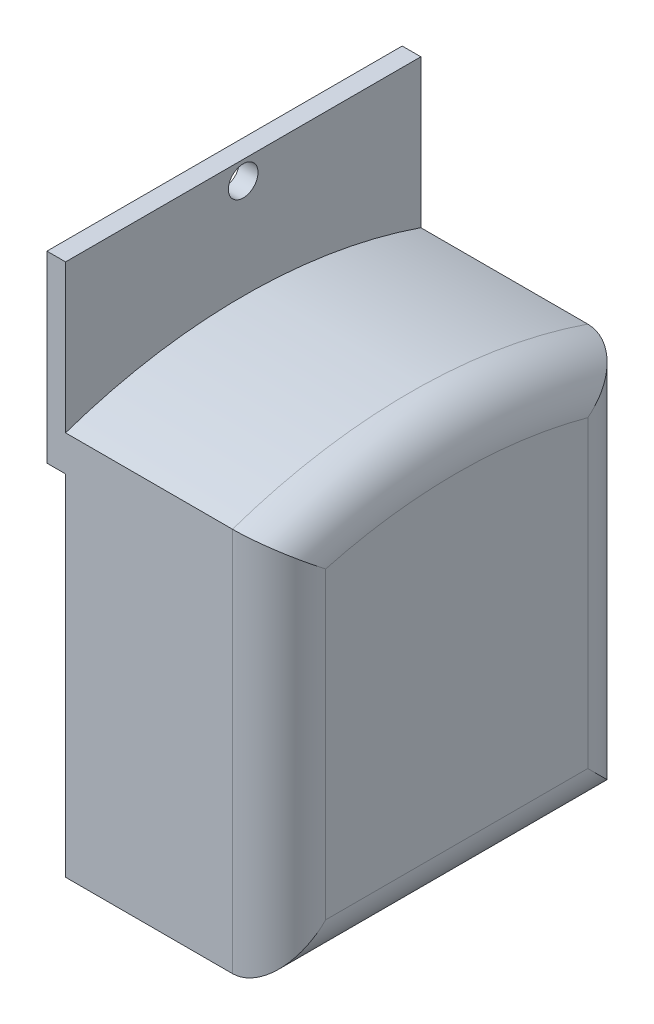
ISO-10303-21;
HEADER;
FILE_DESCRIPTION(('STEP AP214'),'2;1');
FILE_NAME('part.step','',(''),(''),'','','');
FILE_SCHEMA(('AUTOMOTIVE_DESIGN { 1 0 10303 214 1 1 1 1 }'));
ENDSEC;
DATA;
#1=APPLICATION_CONTEXT('core data for automotive mechanical design processes');
#2=APPLICATION_PROTOCOL_DEFINITION('international standard','automotive_design',2000,#1);
#3=PRODUCT_CONTEXT('',#1,'mechanical');
#4=PRODUCT('Part','Part','',(#3));
#5=PRODUCT_RELATED_PRODUCT_CATEGORY('part','',(#4));
#6=PRODUCT_DEFINITION_FORMATION('','',#4);
#7=PRODUCT_DEFINITION_CONTEXT('part definition',#1,'design');
#8=PRODUCT_DEFINITION('design','',#6,#7);
#9=PRODUCT_DEFINITION_SHAPE('','',#8);
#10=(LENGTH_UNIT() NAMED_UNIT(*) SI_UNIT(.MILLI.,.METRE.));
#11=(NAMED_UNIT(*) PLANE_ANGLE_UNIT() SI_UNIT($,.RADIAN.));
#12=(NAMED_UNIT(*) SI_UNIT($,.STERADIAN.) SOLID_ANGLE_UNIT());
#13=UNCERTAINTY_MEASURE_WITH_UNIT(LENGTH_MEASURE(1.E-05),#10,'distance_accuracy_value','');
#14=(GEOMETRIC_REPRESENTATION_CONTEXT(3) GLOBAL_UNCERTAINTY_ASSIGNED_CONTEXT((#13)) GLOBAL_UNIT_ASSIGNED_CONTEXT((#10,
#11,#12)) REPRESENTATION_CONTEXT('',''));
#15=CARTESIAN_POINT('',(0.,0.,0.));
#16=DIRECTION('',(0.,0.,1.));
#17=DIRECTION('',(1.,0.,0.));
#18=AXIS2_PLACEMENT_3D('',#15,#16,#17);
#19=CARTESIAN_POINT('',(45.8,76.2,76.2));
#20=DIRECTION('',(-1.,0.,0.));
#21=DIRECTION('',(0.,-1.,0.));
#22=AXIS2_PLACEMENT_3D('',#19,#20,#21);
#23=PLANE('',#22);
#24=DIRECTION('',(0.,1.,0.));
#25=VECTOR('',#24,1.);
#26=CARTESIAN_POINT('',(45.8,76.2,66.2));
#27=LINE('',#26,#25);
#28=CARTESIAN_POINT('',(45.8,49.7695200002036,66.2));
#29=VERTEX_POINT('',#28);
#30=CARTESIAN_POINT('',(45.8,-15.4,66.2));
#31=VERTEX_POINT('',#30);
#32=EDGE_CURVE('E198',#29,#31,#27,.F.);
#33=ORIENTED_EDGE('',*,*,#32,.T.);
#34=DIRECTION('',(0.,0.,1.));
#35=VECTOR('',#34,1.);
#36=CARTESIAN_POINT('',(45.8,-15.4,0.));
#37=LINE('',#36,#35);
#38=CARTESIAN_POINT('',(45.8,-15.4,9.99999999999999));
#39=VERTEX_POINT('',#38);
#40=EDGE_CURVE('E200',#31,#39,#37,.F.);
#41=ORIENTED_EDGE('',*,*,#40,.T.);
#42=DIRECTION('',(0.,1.,0.));
#43=VECTOR('',#42,1.);
#44=CARTESIAN_POINT('',(45.8,57.15,9.99999999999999));
#45=LINE('',#44,#43);
#46=CARTESIAN_POINT('',(45.8,49.7695200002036,9.99999999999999));
#47=VERTEX_POINT('',#46);
#48=EDGE_CURVE('E194',#39,#47,#45,.T.);
#49=ORIENTED_EDGE('',*,*,#48,.T.);
#50=CARTESIAN_POINT('',(45.8,-53.5754676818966,38.1));
#51=DIRECTION('',(-1.,0.,0.));
#52=DIRECTION('',(0.,-1.,0.));
#53=AXIS2_PLACEMENT_3D('',#50,#51,#52);
#54=CIRCLE('',#53,107.097135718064);
#55=EDGE_CURVE('E196',#47,#29,#54,.F.);
#56=ORIENTED_EDGE('',*,*,#55,.T.);
#57=EDGE_LOOP('',(#33,#41,#49,#56));
#58=FACE_BOUND('',#57,.T.);
#59=ADVANCED_FACE('F39',(#58),#23,.F.);
#60=CARTESIAN_POINT('',(0.,88.9,76.2));
#61=DIRECTION('',(-1.,0.,0.));
#62=DIRECTION('',(0.,0.,1.));
#63=AXIS2_PLACEMENT_3D('',#60,#61,#62);
#64=PLANE('',#63);
#65=CARTESIAN_POINT('',(0.,84.9,38.1));
#66=DIRECTION('',(1.,0.,0.));
#67=DIRECTION('',(0.,0.,-1.));
#68=AXIS2_PLACEMENT_3D('',#65,#66,#67);
#69=CIRCLE('',#68,3.175);
#70=CARTESIAN_POINT('',(0.,84.9,34.925));
#71=VERTEX_POINT('',#70);
#72=EDGE_CURVE('E159',#71,#71,#69,.T.);
#73=ORIENTED_EDGE('',*,*,#72,.F.);
#74=EDGE_LOOP('',(#73));
#75=FACE_BOUND('',#74,.T.);
#76=DIRECTION('',(0.,1.,0.));
#77=VECTOR('',#76,1.);
#78=CARTESIAN_POINT('',(0.,88.9,0.));
#79=LINE('',#78,#77);
#80=CARTESIAN_POINT('',(0.,57.15,0.));
#81=VERTEX_POINT('',#80);
#82=CARTESIAN_POINT('',(0.,88.9,0.));
#83=VERTEX_POINT('',#82);
#84=EDGE_CURVE('E173',#81,#83,#79,.T.);
#85=ORIENTED_EDGE('',*,*,#84,.T.);
#86=DIRECTION('',(0.,0.,-1.));
#87=VECTOR('',#86,1.);
#88=CARTESIAN_POINT('',(0.,88.9,76.2));
#89=LINE('',#88,#87);
#90=CARTESIAN_POINT('',(0.,88.9,76.2));
#91=VERTEX_POINT('',#90);
#92=EDGE_CURVE('E187',#91,#83,#89,.T.);
#93=ORIENTED_EDGE('',*,*,#92,.F.);
#94=DIRECTION('',(0.,1.,0.));
#95=VECTOR('',#94,1.);
#96=CARTESIAN_POINT('',(0.,88.9,76.2));
#97=LINE('',#96,#95);
#98=CARTESIAN_POINT('',(0.,57.15,76.2));
#99=VERTEX_POINT('',#98);
#100=EDGE_CURVE('E137',#99,#91,#97,.T.);
#101=ORIENTED_EDGE('',*,*,#100,.F.);
#102=CARTESIAN_POINT('',(0.,-53.5754676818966,38.1));
#103=DIRECTION('',(1.,0.,0.));
#104=DIRECTION('',(0.,1.,0.));
#105=AXIS2_PLACEMENT_3D('',#102,#103,#104);
#106=CIRCLE('',#105,117.097135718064);
#107=EDGE_CURVE('E147',#99,#81,#106,.F.);
#108=ORIENTED_EDGE('',*,*,#107,.T.);
#109=EDGE_LOOP('',(#85,#93,#101,#108));
#110=FACE_BOUND('',#109,.T.);
#111=ADVANCED_FACE('F229',(#75,#110),#64,.F.);
#112=CARTESIAN_POINT('',(-4.,88.9,76.2));
#113=DIRECTION('',(0.,-1.,0.));
#114=DIRECTION('',(0.,0.,-1.));
#115=AXIS2_PLACEMENT_3D('',#112,#113,#114);
#116=PLANE('',#115);
#117=DIRECTION('',(-1.,0.,0.));
#118=VECTOR('',#117,1.);
#119=CARTESIAN_POINT('',(-4.,88.9,0.));
#120=LINE('',#119,#118);
#121=CARTESIAN_POINT('',(-4.,88.9,0.));
#122=VERTEX_POINT('',#121);
#123=EDGE_CURVE('E175',#83,#122,#120,.T.);
#124=ORIENTED_EDGE('',*,*,#123,.T.);
#125=DIRECTION('',(0.,0.,-1.));
#126=VECTOR('',#125,1.);
#127=CARTESIAN_POINT('',(-4.,88.9,76.2));
#128=LINE('',#127,#126);
#129=CARTESIAN_POINT('',(-4.,88.9,76.2));
#130=VERTEX_POINT('',#129);
#131=EDGE_CURVE('E184',#130,#122,#128,.T.);
#132=ORIENTED_EDGE('',*,*,#131,.F.);
#133=DIRECTION('',(-1.,0.,0.));
#134=VECTOR('',#133,1.);
#135=CARTESIAN_POINT('',(-4.,88.9,76.2));
#136=LINE('',#135,#134);
#137=EDGE_CURVE('E165',#91,#130,#136,.T.);
#138=ORIENTED_EDGE('',*,*,#137,.F.);
#139=ORIENTED_EDGE('',*,*,#92,.T.);
#140=EDGE_LOOP('',(#124,#132,#138,#139));
#141=FACE_BOUND('',#140,.T.);
#142=ADVANCED_FACE('F235',(#141),#116,.F.);
#143=CARTESIAN_POINT('',(-4.,49.5132266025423,76.2));
#144=DIRECTION('',(1.,0.,0.));
#145=DIRECTION('',(0.,0.,-1.));
#146=AXIS2_PLACEMENT_3D('',#143,#144,#145);
#147=PLANE('',#146);
#148=CARTESIAN_POINT('',(-4.00000000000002,84.9,38.1));
#149=DIRECTION('',(1.,0.,0.));
#150=DIRECTION('',(0.,0.,-1.));
#151=AXIS2_PLACEMENT_3D('',#148,#149,#150);
#152=CIRCLE('',#151,3.175);
#153=CARTESIAN_POINT('',(-4.00000000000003,84.9,34.925));
#154=VERTEX_POINT('',#153);
#155=EDGE_CURVE('E163',#154,#154,#152,.T.);
#156=ORIENTED_EDGE('',*,*,#155,.T.);
#157=EDGE_LOOP('',(#156));
#158=FACE_BOUND('',#157,.T.);
#159=DIRECTION('',(0.,-1.,0.));
#160=VECTOR('',#159,1.);
#161=CARTESIAN_POINT('',(-4.,49.5132266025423,0.));
#162=LINE('',#161,#160);
#163=CARTESIAN_POINT('',(-4.,49.5132266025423,0.));
#164=VERTEX_POINT('',#163);
#165=EDGE_CURVE('E177',#122,#164,#162,.T.);
#166=ORIENTED_EDGE('',*,*,#165,.T.);
#167=DIRECTION('',(0.,0.,-1.));
#168=VECTOR('',#167,1.);
#169=CARTESIAN_POINT('',(-4.,49.5132266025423,76.2));
#170=LINE('',#169,#168);
#171=CARTESIAN_POINT('',(-4.,49.5132266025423,76.2));
#172=VERTEX_POINT('',#171);
#173=EDGE_CURVE('E181',#172,#164,#170,.T.);
#174=ORIENTED_EDGE('',*,*,#173,.F.);
#175=DIRECTION('',(0.,-1.,0.));
#176=VECTOR('',#175,1.);
#177=CARTESIAN_POINT('',(-4.,49.5132266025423,76.2));
#178=LINE('',#177,#176);
#179=EDGE_CURVE('E167',#130,#172,#178,.T.);
#180=ORIENTED_EDGE('',*,*,#179,.F.);
#181=ORIENTED_EDGE('',*,*,#131,.T.);
#182=EDGE_LOOP('',(#166,#174,#180,#181));
#183=FACE_BOUND('',#182,.T.);
#184=ADVANCED_FACE('F241',(#158,#183),#147,.F.);
#185=CARTESIAN_POINT('',(0.,49.5132266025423,76.2));
#186=DIRECTION('',(0.,1.,0.));
#187=DIRECTION('',(0.,0.,1.));
#188=AXIS2_PLACEMENT_3D('',#185,#186,#187);
#189=PLANE('',#188);
#190=DIRECTION('',(1.,0.,0.));
#191=VECTOR('',#190,1.);
#192=CARTESIAN_POINT('',(0.,49.5132266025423,0.));
#193=LINE('',#192,#191);
#194=CARTESIAN_POINT('',(0.,49.5132266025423,0.));
#195=VERTEX_POINT('',#194);
#196=EDGE_CURVE('E138',#164,#195,#193,.T.);
#197=ORIENTED_EDGE('',*,*,#196,.T.);
#198=DIRECTION('',(0.,0.,-1.));
#199=VECTOR('',#198,1.);
#200=CARTESIAN_POINT('',(0.,49.5132266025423,76.2));
#201=LINE('',#200,#199);
#202=CARTESIAN_POINT('',(0.,49.5132266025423,76.2));
#203=VERTEX_POINT('',#202);
#204=EDGE_CURVE('E133',#203,#195,#201,.T.);
#205=ORIENTED_EDGE('',*,*,#204,.F.);
#206=DIRECTION('',(1.,0.,0.));
#207=VECTOR('',#206,1.);
#208=CARTESIAN_POINT('',(0.,49.5132266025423,76.2));
#209=LINE('',#208,#207);
#210=EDGE_CURVE('E169',#172,#203,#209,.T.);
#211=ORIENTED_EDGE('',*,*,#210,.F.);
#212=ORIENTED_EDGE('',*,*,#173,.T.);
#213=EDGE_LOOP('',(#197,#205,#211,#212));
#214=FACE_BOUND('',#213,.T.);
#215=ADVANCED_FACE('F245',(#214),#189,.F.);
#216=CARTESIAN_POINT('',(0.,0.,76.2));
#217=DIRECTION('',(1.,0.,0.));
#218=DIRECTION('',(0.,1.,0.));
#219=AXIS2_PLACEMENT_3D('',#216,#217,#218);
#220=PLANE('',#219);
#221=DIRECTION('',(0.,-1.,0.));
#222=VECTOR('',#221,1.);
#223=CARTESIAN_POINT('',(0.,0.,0.));
#224=LINE('',#223,#222);
#225=CARTESIAN_POINT('',(0.,-25.4,0.));
#226=VERTEX_POINT('',#225);
#227=EDGE_CURVE('E126',#195,#226,#224,.T.);
#228=ORIENTED_EDGE('',*,*,#227,.T.);
#229=DIRECTION('',(0.,0.,1.));
#230=VECTOR('',#229,1.);
#231=CARTESIAN_POINT('',(0.,-25.4,0.));
#232=LINE('',#231,#230);
#233=CARTESIAN_POINT('',(0.,-25.4,76.2));
#234=VERTEX_POINT('',#233);
#235=EDGE_CURVE('E130',#226,#234,#232,.T.);
#236=ORIENTED_EDGE('',*,*,#235,.T.);
#237=DIRECTION('',(0.,-1.,0.));
#238=VECTOR('',#237,1.);
#239=CARTESIAN_POINT('',(0.,0.,76.2));
#240=LINE('',#239,#238);
#241=EDGE_CURVE('E171',#203,#234,#240,.T.);
#242=ORIENTED_EDGE('',*,*,#241,.F.);
#243=ORIENTED_EDGE('',*,*,#204,.T.);
#244=EDGE_LOOP('',(#228,#236,#242,#243));
#245=FACE_BOUND('',#244,.T.);
#246=ADVANCED_FACE('F128',(#245),#220,.F.);
#247=CARTESIAN_POINT('',(0.,0.,76.2));
#248=DIRECTION('',(0.,0.,-1.));
#249=DIRECTION('',(-1.,0.,0.));
#250=AXIS2_PLACEMENT_3D('',#247,#248,#249);
#251=PLANE('',#250);
#252=DIRECTION('',(1.,0.,0.));
#253=VECTOR('',#252,1.);
#254=CARTESIAN_POINT('',(45.8,-25.4,76.2));
#255=LINE('',#254,#253);
#256=CARTESIAN_POINT('',(35.8,-25.4,76.2));
#257=VERTEX_POINT('',#256);
#258=EDGE_CURVE('E146',#234,#257,#255,.T.);
#259=ORIENTED_EDGE('',*,*,#258,.T.);
#260=DIRECTION('',(0.,1.,0.));
#261=VECTOR('',#260,1.);
#262=CARTESIAN_POINT('',(35.8,0.,76.2));
#263=LINE('',#262,#261);
#264=CARTESIAN_POINT('',(35.8,57.15,76.2));
#265=VERTEX_POINT('',#264);
#266=EDGE_CURVE('E69',#257,#265,#263,.T.);
#267=ORIENTED_EDGE('',*,*,#266,.T.);
#268=DIRECTION('',(1.,0.,0.));
#269=VECTOR('',#268,1.);
#270=CARTESIAN_POINT('',(0.,57.15,76.2));
#271=LINE('',#270,#269);
#272=EDGE_CURVE('E156',#99,#265,#271,.T.);
#273=ORIENTED_EDGE('',*,*,#272,.F.);
#274=ORIENTED_EDGE('',*,*,#100,.T.);
#275=ORIENTED_EDGE('',*,*,#137,.T.);
#276=ORIENTED_EDGE('',*,*,#179,.T.);
#277=ORIENTED_EDGE('',*,*,#210,.T.);
#278=ORIENTED_EDGE('',*,*,#241,.T.);
#279=EDGE_LOOP('',(#259,#267,#273,#274,#275,#276,#277,#278));
#280=FACE_BOUND('',#279,.T.);
#281=ADVANCED_FACE('F252',(#280),#251,.F.);
#282=CARTESIAN_POINT('',(0.,0.,0.));
#283=DIRECTION('',(0.,0.,-1.));
#284=DIRECTION('',(-1.,0.,0.));
#285=AXIS2_PLACEMENT_3D('',#282,#283,#284);
#286=PLANE('',#285);
#287=DIRECTION('',(1.,0.,0.));
#288=VECTOR('',#287,1.);
#289=CARTESIAN_POINT('',(0.,57.15,0.));
#290=LINE('',#289,#288);
#291=CARTESIAN_POINT('',(35.8,57.15,0.));
#292=VERTEX_POINT('',#291);
#293=EDGE_CURVE('E157',#81,#292,#290,.T.);
#294=ORIENTED_EDGE('',*,*,#293,.T.);
#295=DIRECTION('',(0.,1.,0.));
#296=VECTOR('',#295,1.);
#297=CARTESIAN_POINT('',(35.8,-25.4,0.));
#298=LINE('',#297,#296);
#299=CARTESIAN_POINT('',(35.8,-25.4,0.));
#300=VERTEX_POINT('',#299);
#301=EDGE_CURVE('E11',#292,#300,#298,.F.);
#302=ORIENTED_EDGE('',*,*,#301,.T.);
#303=DIRECTION('',(1.,0.,0.));
#304=VECTOR('',#303,1.);
#305=CARTESIAN_POINT('',(45.8,-25.4,0.));
#306=LINE('',#305,#304);
#307=EDGE_CURVE('E144',#226,#300,#306,.T.);
#308=ORIENTED_EDGE('',*,*,#307,.F.);
#309=ORIENTED_EDGE('',*,*,#227,.F.);
#310=ORIENTED_EDGE('',*,*,#196,.F.);
#311=ORIENTED_EDGE('',*,*,#165,.F.);
#312=ORIENTED_EDGE('',*,*,#123,.F.);
#313=ORIENTED_EDGE('',*,*,#84,.F.);
#314=EDGE_LOOP('',(#294,#302,#308,#309,#310,#311,#312,#313));
#315=FACE_BOUND('',#314,.T.);
#316=ADVANCED_FACE('F149',(#315),#286,.T.);
#317=CARTESIAN_POINT('',(-76.2,84.9,38.1));
#318=DIRECTION('',(1.,0.,0.));
#319=DIRECTION('',(0.,0.,-1.));
#320=AXIS2_PLACEMENT_3D('',#317,#318,#319);
#321=CYLINDRICAL_SURFACE('',#320,3.175);
#322=CARTESIAN_POINT('',(0.,84.9,34.925));
#323=CARTESIAN_POINT('',(-0.0416666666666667,84.9,34.925));
#324=CARTESIAN_POINT('',(-0.0833333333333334,84.9,34.925));
#325=CARTESIAN_POINT('',(-0.166666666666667,84.9,34.925));
#326=CARTESIAN_POINT('',(-0.208333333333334,84.9,34.925));
#327=CARTESIAN_POINT('',(-0.291666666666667,84.9,34.925));
#328=CARTESIAN_POINT('',(-0.333333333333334,84.9,34.925));
#329=CARTESIAN_POINT('',(-0.416666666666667,84.9,34.925));
#330=CARTESIAN_POINT('',(-0.458333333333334,84.9,34.925));
#331=CARTESIAN_POINT('',(-0.541666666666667,84.9,34.925));
#332=CARTESIAN_POINT('',(-0.583333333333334,84.9,34.925));
#333=CARTESIAN_POINT('',(-0.666666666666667,84.9,34.925));
#334=CARTESIAN_POINT('',(-0.708333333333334,84.9,34.925));
#335=CARTESIAN_POINT('',(-0.791666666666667,84.9,34.925));
#336=CARTESIAN_POINT('',(-0.833333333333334,84.9,34.925));
#337=CARTESIAN_POINT('',(-0.916666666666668,84.9,34.925));
#338=CARTESIAN_POINT('',(-0.958333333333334,84.9,34.925));
#339=CARTESIAN_POINT('',(-1.04166666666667,84.9,34.925));
#340=CARTESIAN_POINT('',(-1.08333333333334,84.9,34.925));
#341=CARTESIAN_POINT('',(-1.16666666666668,84.9,34.925));
#342=CARTESIAN_POINT('',(-1.20833333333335,84.9,34.925));
#343=CARTESIAN_POINT('',(-1.29166666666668,84.9,34.925));
#344=CARTESIAN_POINT('',(-1.33333333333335,84.9,34.925));
#345=CARTESIAN_POINT('',(-1.41666666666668,84.9,34.925));
#346=CARTESIAN_POINT('',(-1.45833333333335,84.9,34.925));
#347=CARTESIAN_POINT('',(-1.54166666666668,84.9,34.925));
#348=CARTESIAN_POINT('',(-1.58333333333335,84.9,34.925));
#349=CARTESIAN_POINT('',(-1.66666666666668,84.9,34.925));
#350=CARTESIAN_POINT('',(-1.70833333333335,84.9,34.925));
#351=CARTESIAN_POINT('',(-1.79166666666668,84.9,34.925));
#352=CARTESIAN_POINT('',(-1.83333333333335,84.9,34.925));
#353=CARTESIAN_POINT('',(-1.91666666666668,84.9,34.925));
#354=CARTESIAN_POINT('',(-1.95833333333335,84.9,34.925));
#355=CARTESIAN_POINT('',(-2.04166666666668,84.9,34.925));
#356=CARTESIAN_POINT('',(-2.08333333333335,84.9,34.925));
#357=CARTESIAN_POINT('',(-2.16666666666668,84.9,34.925));
#358=CARTESIAN_POINT('',(-2.20833333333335,84.9,34.925));
#359=CARTESIAN_POINT('',(-2.29166666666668,84.9,34.925));
#360=CARTESIAN_POINT('',(-2.33333333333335,84.9,34.925));
#361=CARTESIAN_POINT('',(-2.41666666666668,84.9,34.925));
#362=CARTESIAN_POINT('',(-2.45833333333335,84.9,34.925));
#363=CARTESIAN_POINT('',(-2.54166666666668,84.9,34.925));
#364=CARTESIAN_POINT('',(-2.58333333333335,84.9,34.925));
#365=CARTESIAN_POINT('',(-2.66666666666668,84.9,34.925));
#366=CARTESIAN_POINT('',(-2.70833333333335,84.9,34.925));
#367=CARTESIAN_POINT('',(-2.79166666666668,84.9,34.925));
#368=CARTESIAN_POINT('',(-2.83333333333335,84.9,34.925));
#369=CARTESIAN_POINT('',(-2.91666666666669,84.9,34.925));
#370=CARTESIAN_POINT('',(-2.95833333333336,84.9,34.925));
#371=CARTESIAN_POINT('',(-3.0416666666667,84.9,34.925));
#372=CARTESIAN_POINT('',(-3.08333333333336,84.9,34.925));
#373=CARTESIAN_POINT('',(-3.1666666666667,84.9,34.925));
#374=CARTESIAN_POINT('',(-3.20833333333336,84.9,34.925));
#375=CARTESIAN_POINT('',(-3.2916666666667,84.9,34.925));
#376=CARTESIAN_POINT('',(-3.33333333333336,84.9,34.925));
#377=CARTESIAN_POINT('',(-3.4166666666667,84.9,34.925));
#378=CARTESIAN_POINT('',(-3.45833333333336,84.9,34.925));
#379=CARTESIAN_POINT('',(-3.5416666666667,84.9,34.925));
#380=CARTESIAN_POINT('',(-3.58333333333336,84.9,34.925));
#381=CARTESIAN_POINT('',(-3.6666666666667,84.9,34.925));
#382=CARTESIAN_POINT('',(-3.70833333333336,84.9,34.925));
#383=CARTESIAN_POINT('',(-3.7916666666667,84.9,34.925));
#384=CARTESIAN_POINT('',(-3.83333333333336,84.9,34.925));
#385=CARTESIAN_POINT('',(-3.9166666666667,84.9,34.925));
#386=CARTESIAN_POINT('',(-3.95833333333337,84.9,34.925));
#387=CARTESIAN_POINT('',(-4.00000000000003,84.9,34.925));
#388=B_SPLINE_CURVE_WITH_KNOTS('',3,(#322,#323,#324,#325,#326,#327,#328,#329,#330,#331,#332,
#333,#334,#335,#336,#337,#338,#339,#340,#341,#342,#343,#344,#345,#346,#347,#348,#349,#350,#351,
#352,#353,#354,#355,#356,#357,#358,#359,#360,#361,#362,#363,#364,#365,#366,#367,#368,#369,#370,
#371,#372,#373,#374,#375,#376,#377,#378,#379,#380,#381,#382,#383,#384,#385,#386,#387),
.UNSPECIFIED.,.F.,.F.,(4,2,2,2,2,2,2,2,2,2,2,2,2,2,2,2,2,2,2,2,2,2,2,2,2,2,2,2,2,2,2,2,4),(0.,
0.125,0.25,0.375,0.5,0.625000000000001,0.750000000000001,0.875000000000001,1.,1.12500000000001,
1.25000000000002,1.37500000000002,1.50000000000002,1.62500000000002,1.75000000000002,
1.87500000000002,2.00000000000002,2.12500000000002,2.25000000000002,2.37500000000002,
2.50000000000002,2.62500000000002,2.75000000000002,2.87500000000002,3.00000000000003,
3.12500000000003,3.25000000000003,3.37500000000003,3.50000000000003,3.62500000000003,
3.75000000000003,3.87500000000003,4.00000000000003),.UNSPECIFIED.);
#389=EDGE_CURVE('BSEAM255',#71,#154,#388,.T.);
#390=ORIENTED_EDGE('',*,*,#72,.T.);
#391=ORIENTED_EDGE('',*,*,#155,.F.);
#392=ORIENTED_EDGE('',*,*,#389,.T.);
#393=ORIENTED_EDGE('',*,*,#389,.F.);
#394=EDGE_LOOP('',(#390,#392,#391,#393));
#395=FACE_BOUND('',#394,.T.);
#396=ADVANCED_FACE('F255',(#395),#321,.F.);
#397=CARTESIAN_POINT('',(0.,-53.5754676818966,38.1));
#398=DIRECTION('',(1.,0.,0.));
#399=DIRECTION('',(0.,1.,0.));
#400=AXIS2_PLACEMENT_3D('',#397,#398,#399);
#401=CYLINDRICAL_SURFACE('',#400,117.097135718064);
#402=ORIENTED_EDGE('',*,*,#272,.T.);
#403=CARTESIAN_POINT('',(35.8,-53.5754676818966,38.1));
#404=DIRECTION('',(-1.,0.,0.));
#405=DIRECTION('',(0.,-1.,0.));
#406=AXIS2_PLACEMENT_3D('',#403,#404,#405);
#407=CIRCLE('',#406,117.097135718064);
#408=EDGE_CURVE('E54',#265,#292,#407,.T.);
#409=ORIENTED_EDGE('',*,*,#408,.T.);
#410=ORIENTED_EDGE('',*,*,#293,.F.);
#411=ORIENTED_EDGE('',*,*,#107,.F.);
#412=EDGE_LOOP('',(#402,#409,#410,#411));
#413=FACE_BOUND('',#412,.T.);
#414=ADVANCED_FACE('F260',(#413),#401,.T.);
#415=CARTESIAN_POINT('',(45.8,-25.4,0.));
#416=DIRECTION('',(0.,-1.,0.));
#417=DIRECTION('',(1.,0.,0.));
#418=AXIS2_PLACEMENT_3D('',#415,#416,#417);
#419=PLANE('',#418);
#420=ORIENTED_EDGE('',*,*,#307,.T.);
#421=DIRECTION('',(0.,0.,1.));
#422=VECTOR('',#421,1.);
#423=CARTESIAN_POINT('',(35.8,-25.4,76.2));
#424=LINE('',#423,#422);
#425=EDGE_CURVE('E190',#300,#257,#424,.T.);
#426=ORIENTED_EDGE('',*,*,#425,.T.);
#427=ORIENTED_EDGE('',*,*,#258,.F.);
#428=ORIENTED_EDGE('',*,*,#235,.F.);
#429=EDGE_LOOP('',(#420,#426,#427,#428));
#430=FACE_BOUND('',#429,.T.);
#431=ADVANCED_FACE('F142',(#430),#419,.T.);
#432=CARTESIAN_POINT('',(35.8,-53.5754676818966,38.1));
#433=DIRECTION('',(-1.,0.,0.));
#434=DIRECTION('',(0.,-1.,0.));
#435=AXIS2_PLACEMENT_3D('',#432,#433,#434);
#436=TOROIDAL_SURFACE('',#435,107.097135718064,10.);
#437=CARTESIAN_POINT('',(35.8,57.15,76.2));
#438=CARTESIAN_POINT('',(35.9218694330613,57.1500006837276,76.2000011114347));
#439=CARTESIAN_POINT('',(36.0437220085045,57.1484101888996,76.1977716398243));
#440=CARTESIAN_POINT('',(36.2871770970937,57.1420580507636,76.1888685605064));
#441=CARTESIAN_POINT('',(36.40877962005,57.1372965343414,76.18219513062));
#442=CARTESIAN_POINT('',(36.7727396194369,57.1182805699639,76.1555460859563));
#443=CARTESIAN_POINT('',(37.0144133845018,57.0992946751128,76.1289416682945));
#444=CARTESIAN_POINT('',(37.4925968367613,57.0491197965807,76.0586628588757));
#445=CARTESIAN_POINT('',(37.7291272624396,57.0179967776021,76.0150807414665));
#446=CARTESIAN_POINT('',(38.196700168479,56.9439815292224,75.9114964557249));
#447=CARTESIAN_POINT('',(38.4277422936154,56.9010885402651,75.8514932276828));
#448=CARTESIAN_POINT('',(38.8824079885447,56.8041863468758,75.7160361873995));
#449=CARTESIAN_POINT('',(39.1060431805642,56.750195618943,75.6406080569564));
#450=CARTESIAN_POINT('',(39.5450789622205,56.6316977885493,75.4752054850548));
#451=CARTESIAN_POINT('',(39.7604763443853,56.567186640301,75.3852254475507));
#452=CARTESIAN_POINT('',(40.1820035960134,56.4283452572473,75.1917662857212));
#453=CARTESIAN_POINT('',(40.3881273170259,56.3540086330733,75.0882783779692));
#454=CARTESIAN_POINT('',(40.7901688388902,56.1962819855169,74.8689492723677));
#455=CARTESIAN_POINT('',(40.9860826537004,56.1128884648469,74.7531033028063));
#456=CARTESIAN_POINT('',(41.3791767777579,55.9322186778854,74.5024416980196));
#457=CARTESIAN_POINT('',(41.5756339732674,55.8343952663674,74.3668862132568));
#458=CARTESIAN_POINT('',(41.9556172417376,55.6302744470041,74.0844453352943));
#459=CARTESIAN_POINT('',(42.1391386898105,55.523974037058,73.9375559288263));
#460=CARTESIAN_POINT('',(42.6695578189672,55.1937154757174,73.4819121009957));
#461=CARTESIAN_POINT('',(42.9965595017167,54.9582838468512,73.1580206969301));
#462=CARTESIAN_POINT('',(43.6482574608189,54.419872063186,72.4199874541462));
#463=CARTESIAN_POINT('',(43.9624379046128,54.1122936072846,71.9999905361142));
#464=CARTESIAN_POINT('',(44.5155134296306,53.472260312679,71.130096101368));
#465=CARTESIAN_POINT('',(44.7543265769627,53.139778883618,70.6801666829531));
#466=CARTESIAN_POINT('',(45.1973900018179,52.3904778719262,69.6711950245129));
#467=CARTESIAN_POINT('',(45.385769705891,51.9698727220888,69.1080103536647));
#468=CARTESIAN_POINT('',(45.6596296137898,51.1140507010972,67.9692159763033));
#469=CARTESIAN_POINT('',(45.7452469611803,50.6788541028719,67.3936238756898));
#470=CARTESIAN_POINT('',(45.7933109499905,50.0881337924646,66.6173082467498));
#471=CARTESIAN_POINT('',(45.7996626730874,49.9351194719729,66.4166641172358));
#472=CARTESIAN_POINT('',(45.7999956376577,49.7777628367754,66.2107836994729));
#473=CARTESIAN_POINT('',(45.7999999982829,49.7736414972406,66.2053917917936));
#474=CARTESIAN_POINT('',(45.8,49.7695200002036,66.2));
#475=B_SPLINE_CURVE_WITH_KNOTS('',3,(#437,#438,#439,#440,#441,#442,#443,#444,#445,#446,#447,
#448,#449,#450,#451,#452,#453,#454,#455,#456,#457,#458,#459,#460,#461,#462,#463,#464,#465,#466,
#467,#468,#469,#470,#471,#472,#473,#474),.UNSPECIFIED.,.F.,.F.,(4,2,2,2,2,2,2,2,2,2,2,2,2,2,2,2,
2,2,4),(0.,0.365544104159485,0.731073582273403,1.46164274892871,2.18829543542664,
2.91499502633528,3.64049440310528,4.36627344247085,5.09252678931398,5.81906158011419,
6.59214663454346,7.36550670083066,8.91127946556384,10.728856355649,12.5484024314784,
14.7234711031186,16.8956337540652,17.6526619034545,17.6730217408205),.UNSPECIFIED.);
#476=EDGE_CURVE('E208',#29,#265,#475,.F.);
#477=ORIENTED_EDGE('',*,*,#476,.F.);
#478=ORIENTED_EDGE('',*,*,#55,.F.);
#479=CARTESIAN_POINT('',(35.8,57.15,0.));
#480=CARTESIAN_POINT('',(35.9218694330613,57.1500006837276,-1.11143468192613E-06));
#481=CARTESIAN_POINT('',(36.0437220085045,57.1484101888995,0.00222836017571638));
#482=CARTESIAN_POINT('',(36.2871770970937,57.1420580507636,0.0111314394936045));
#483=CARTESIAN_POINT('',(36.40877962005,57.1372965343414,0.0178048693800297));
#484=CARTESIAN_POINT('',(36.7727396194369,57.1182805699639,0.0444539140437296));
#485=CARTESIAN_POINT('',(37.0144133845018,57.0992946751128,0.0710583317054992));
#486=CARTESIAN_POINT('',(37.4925968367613,57.0491197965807,0.141337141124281));
#487=CARTESIAN_POINT('',(37.7291272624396,57.0179967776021,0.184919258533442));
#488=CARTESIAN_POINT('',(38.1967001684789,56.9439815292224,0.28850354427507));
#489=CARTESIAN_POINT('',(38.4277422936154,56.9010885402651,0.348506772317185));
#490=CARTESIAN_POINT('',(38.8824079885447,56.8041863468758,0.483963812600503));
#491=CARTESIAN_POINT('',(39.1060431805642,56.750195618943,0.559391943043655));
#492=CARTESIAN_POINT('',(39.5450789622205,56.6316977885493,0.724794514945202));
#493=CARTESIAN_POINT('',(39.7604763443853,56.567186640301,0.81477455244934));
#494=CARTESIAN_POINT('',(40.1820035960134,56.4283452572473,1.00823371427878));
#495=CARTESIAN_POINT('',(40.3881273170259,56.3540086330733,1.11172162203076));
#496=CARTESIAN_POINT('',(40.7901688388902,56.1962819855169,1.33105072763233));
#497=CARTESIAN_POINT('',(40.9860826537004,56.1128884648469,1.44689669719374));
#498=CARTESIAN_POINT('',(41.3791767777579,55.9322186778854,1.69755830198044));
#499=CARTESIAN_POINT('',(41.5756339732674,55.8343952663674,1.83311378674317));
#500=CARTESIAN_POINT('',(41.9556172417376,55.6302744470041,2.11555466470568));
#501=CARTESIAN_POINT('',(42.1391386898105,55.523974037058,2.26244407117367));
#502=CARTESIAN_POINT('',(42.6695578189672,55.1937154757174,2.71808789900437));
#503=CARTESIAN_POINT('',(42.9965595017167,54.9582838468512,3.0419793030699));
#504=CARTESIAN_POINT('',(43.6482574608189,54.4198720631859,3.78001254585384));
#505=CARTESIAN_POINT('',(43.9624379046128,54.1122936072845,4.20000946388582));
#506=CARTESIAN_POINT('',(44.5155134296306,53.4722603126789,5.06990389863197));
#507=CARTESIAN_POINT('',(44.7543265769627,53.139778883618,5.51983331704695));
#508=CARTESIAN_POINT('',(45.1973900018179,52.3904778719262,6.52880497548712));
#509=CARTESIAN_POINT('',(45.385769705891,51.9698727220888,7.09198964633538));
#510=CARTESIAN_POINT('',(45.6596296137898,51.1140507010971,8.23078402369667));
#511=CARTESIAN_POINT('',(45.7452469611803,50.6788541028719,8.80637612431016));
#512=CARTESIAN_POINT('',(45.7933109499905,50.0881337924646,9.58269175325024));
#513=CARTESIAN_POINT('',(45.7996626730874,49.9351194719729,9.78333588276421));
#514=CARTESIAN_POINT('',(45.7999956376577,49.7777628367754,9.98921630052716));
#515=CARTESIAN_POINT('',(45.7999999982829,49.7736414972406,9.99460820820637));
#516=CARTESIAN_POINT('',(45.8,49.7695200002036,10.));
#517=B_SPLINE_CURVE_WITH_KNOTS('',3,(#479,#480,#481,#482,#483,#484,#485,#486,#487,#488,#489,
#490,#491,#492,#493,#494,#495,#496,#497,#498,#499,#500,#501,#502,#503,#504,#505,#506,#507,#508,
#509,#510,#511,#512,#513,#514,#515,#516),.UNSPECIFIED.,.F.,.F.,(4,2,2,2,2,2,2,2,2,2,2,2,2,2,2,2,
2,2,4),(0.,0.365544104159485,0.731073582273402,1.46164274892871,2.18829543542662,
2.91499502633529,3.64049440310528,4.36627344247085,5.09252678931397,5.81906158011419,
6.59214663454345,7.36550670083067,8.91127946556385,10.728856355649,12.5484024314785,
14.7234711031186,16.8956337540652,17.6526619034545,17.6730217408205),.UNSPECIFIED.);
#518=EDGE_CURVE('E44',#292,#47,#517,.T.);
#519=ORIENTED_EDGE('',*,*,#518,.F.);
#520=ORIENTED_EDGE('',*,*,#408,.F.);
#521=EDGE_LOOP('',(#477,#478,#519,#520));
#522=FACE_BOUND('',#521,.T.);
#523=ADVANCED_FACE('F214',(#522),#436,.T.);
#524=CARTESIAN_POINT('',(35.8,76.2,9.99999999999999));
#525=DIRECTION('',(0.,-1.,0.));
#526=DIRECTION('',(1.,0.,0.));
#527=AXIS2_PLACEMENT_3D('',#524,#525,#526);
#528=CYLINDRICAL_SURFACE('',#527,10.);
#529=ORIENTED_EDGE('',*,*,#518,.T.);
#530=ORIENTED_EDGE('',*,*,#48,.F.);
#531=CARTESIAN_POINT('',(35.8,-15.4,9.99999999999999));
#532=DIRECTION('',(0.,-0.707106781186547,0.707106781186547));
#533=DIRECTION('',(0.,-0.707106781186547,-0.707106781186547));
#534=AXIS2_PLACEMENT_3D('',#531,#532,#533);
#535=ELLIPSE('',#534,14.1421356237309,10.);
#536=EDGE_CURVE('E207',#300,#39,#535,.T.);
#537=ORIENTED_EDGE('',*,*,#536,.F.);
#538=ORIENTED_EDGE('',*,*,#301,.F.);
#539=EDGE_LOOP('',(#529,#530,#537,#538));
#540=FACE_BOUND('',#539,.T.);
#541=ADVANCED_FACE('F41',(#540),#528,.T.);
#542=CARTESIAN_POINT('',(35.8,0.,66.2));
#543=DIRECTION('',(0.,1.,0.));
#544=DIRECTION('',(-1.,0.,0.));
#545=AXIS2_PLACEMENT_3D('',#542,#543,#544);
#546=CYLINDRICAL_SURFACE('',#545,10.);
#547=ORIENTED_EDGE('',*,*,#476,.T.);
#548=ORIENTED_EDGE('',*,*,#266,.F.);
#549=CARTESIAN_POINT('',(35.8,-15.4,66.2));
#550=DIRECTION('',(0.,0.707106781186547,0.707106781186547));
#551=DIRECTION('',(0.,0.707106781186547,-0.707106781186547));
#552=AXIS2_PLACEMENT_3D('',#549,#550,#551);
#553=ELLIPSE('',#552,14.1421356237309,10.);
#554=EDGE_CURVE('E205',#31,#257,#553,.F.);
#555=ORIENTED_EDGE('',*,*,#554,.F.);
#556=ORIENTED_EDGE('',*,*,#32,.F.);
#557=EDGE_LOOP('',(#547,#548,#555,#556));
#558=FACE_BOUND('',#557,.T.);
#559=ADVANCED_FACE('F217',(#558),#546,.T.);
#560=CARTESIAN_POINT('',(35.8,-15.4,0.));
#561=DIRECTION('',(0.,0.,-1.));
#562=DIRECTION('',(-1.,0.,0.));
#563=AXIS2_PLACEMENT_3D('',#560,#561,#562);
#564=CYLINDRICAL_SURFACE('',#563,10.);
#565=ORIENTED_EDGE('',*,*,#536,.T.);
#566=ORIENTED_EDGE('',*,*,#40,.F.);
#567=ORIENTED_EDGE('',*,*,#554,.T.);
#568=ORIENTED_EDGE('',*,*,#425,.F.);
#569=EDGE_LOOP('',(#565,#566,#567,#568));
#570=FACE_BOUND('',#569,.T.);
#571=ADVANCED_FACE('F220',(#570),#564,.T.);
#572=CLOSED_SHELL('',(#59,#111,#142,#184,#215,#246,#281,#316,#396,#414,#431,#523,#541,#559,#571));
#573=MANIFOLD_SOLID_BREP('B2',#572);
#574=ADVANCED_BREP_SHAPE_REPRESENTATION('',(#18,#573),#14);
#575=SHAPE_DEFINITION_REPRESENTATION(#9,#574);
ENDSEC;
END-ISO-10303-21;
